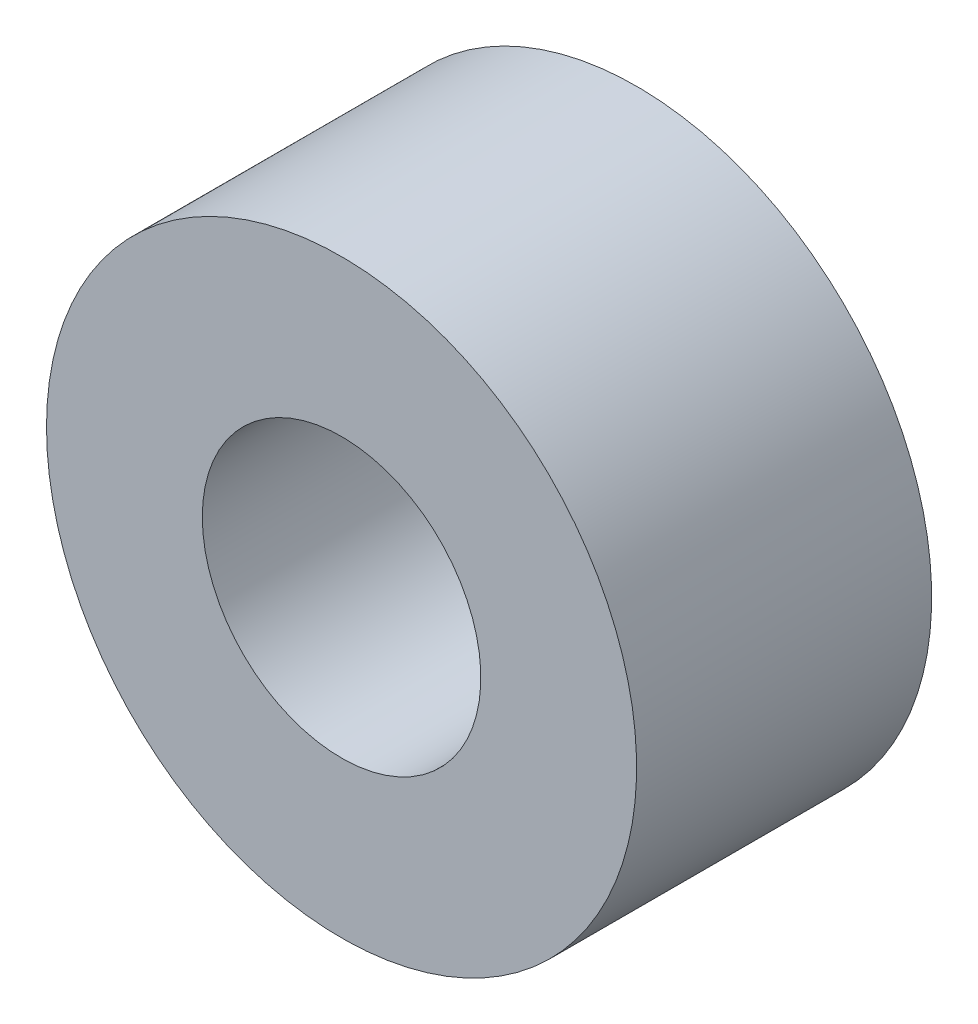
from build123d import *

# Parameters (mm, degrees)
SKETCH1_R                  = 3.175004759
EXTRUDE1_DEPTH             = 3.175
F_31_0_12_DIAMETER_HOLE1_D = 2.9972


with BuildPart() as part:
    # Sketch1 → Extrude1 (new body)
    with BuildSketch(Plane(origin=(0, 0, 0), x_dir=(-1, 0, 0), z_dir=(0, 0, -1))):
        Circle(SKETCH1_R)
    extrude(amount=EXTRUDE1_DEPTH)

    # 31 _0.12_ Diameter Hole1 (through all)
    with Locations(Plane(origin=(0, 0, -3.175), x_dir=(-1, 0, 0), z_dir=(0, 0, -1))):
        with Locations((0, 0)):
            Hole(F_31_0_12_DIAMETER_HOLE1_D / 2)


solid = part.part
